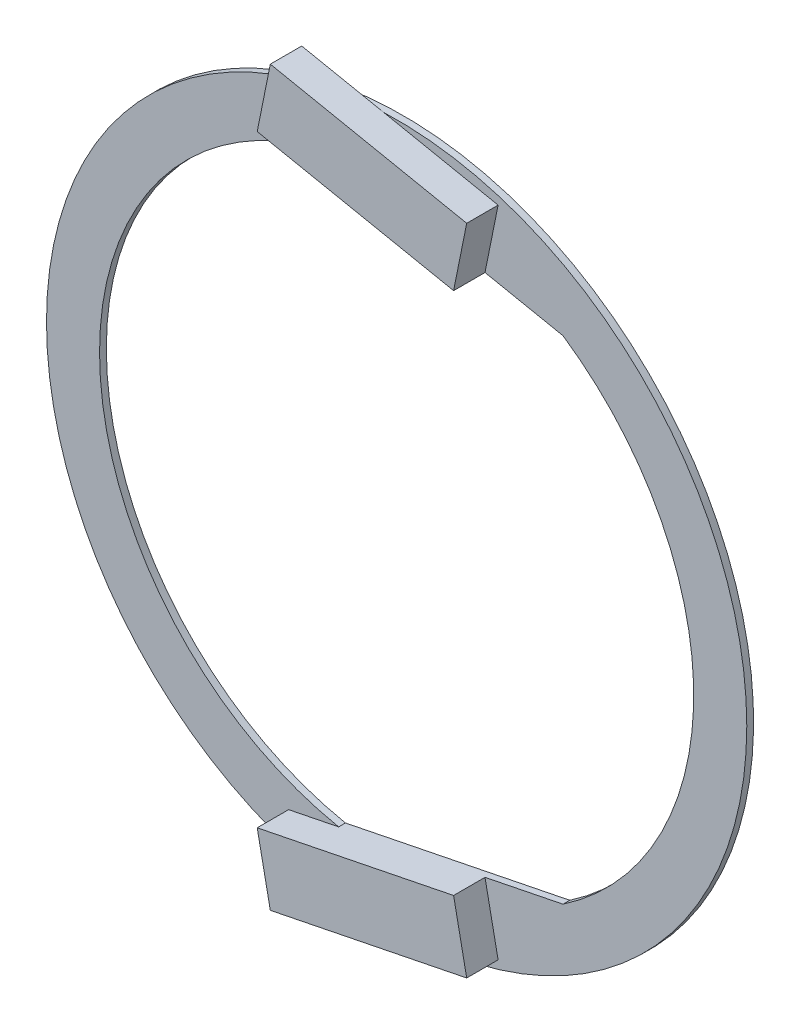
ISO-10303-21;
HEADER;
FILE_DESCRIPTION(('STEP AP214'),'2;1');
FILE_NAME('part.step','',(''),(''),'','','');
FILE_SCHEMA(('AUTOMOTIVE_DESIGN { 1 0 10303 214 1 1 1 1 }'));
ENDSEC;
DATA;
#1=APPLICATION_CONTEXT('core data for automotive mechanical design processes');
#2=APPLICATION_PROTOCOL_DEFINITION('international standard','automotive_design',2000,#1);
#3=PRODUCT_CONTEXT('',#1,'mechanical');
#4=PRODUCT('Part','Part','',(#3));
#5=PRODUCT_RELATED_PRODUCT_CATEGORY('part','',(#4));
#6=PRODUCT_DEFINITION_FORMATION('','',#4);
#7=PRODUCT_DEFINITION_CONTEXT('part definition',#1,'design');
#8=PRODUCT_DEFINITION('design','',#6,#7);
#9=PRODUCT_DEFINITION_SHAPE('','',#8);
#10=(LENGTH_UNIT() NAMED_UNIT(*) SI_UNIT(.MILLI.,.METRE.));
#11=(NAMED_UNIT(*) PLANE_ANGLE_UNIT() SI_UNIT($,.RADIAN.));
#12=(NAMED_UNIT(*) SI_UNIT($,.STERADIAN.) SOLID_ANGLE_UNIT());
#13=UNCERTAINTY_MEASURE_WITH_UNIT(LENGTH_MEASURE(1.E-05),#10,'distance_accuracy_value','');
#14=(GEOMETRIC_REPRESENTATION_CONTEXT(3) GLOBAL_UNCERTAINTY_ASSIGNED_CONTEXT((#13)) GLOBAL_UNIT_ASSIGNED_CONTEXT((#10,
#11,#12)) REPRESENTATION_CONTEXT('',''));
#15=CARTESIAN_POINT('',(0.,0.,0.));
#16=DIRECTION('',(0.,0.,1.));
#17=DIRECTION('',(1.,0.,0.));
#18=AXIS2_PLACEMENT_3D('',#15,#16,#17);
#19=CARTESIAN_POINT('',(0.,0.,0.));
#20=DIRECTION('',(0.,0.,-1.));
#21=DIRECTION('',(-1.,0.,0.));
#22=AXIS2_PLACEMENT_3D('',#19,#20,#21);
#23=PLANE('',#22);
#24=DIRECTION('',(-0.980271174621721,-0.19765734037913,0.));
#25=VECTOR('',#24,1.);
#26=CARTESIAN_POINT('',(-16.1606892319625,-45.1041303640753,0.));
#27=LINE('',#26,#25);
#28=CARTESIAN_POINT('',(-8.67627650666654,-43.5950080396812,0.));
#29=VERTEX_POINT('',#28);
#30=CARTESIAN_POINT('',(-16.1606892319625,-45.1041303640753,0.));
#31=VERTEX_POINT('',#30);
#32=EDGE_CURVE('E161',#29,#31,#27,.T.);
#33=ORIENTED_EDGE('',*,*,#32,.F.);
#34=CARTESIAN_POINT('',(0.,0.,0.));
#35=DIRECTION('',(0.,0.,-1.));
#36=DIRECTION('',(-1.,0.,0.));
#37=AXIS2_PLACEMENT_3D('',#34,#35,#36);
#38=CIRCLE('',#37,44.45);
#39=CARTESIAN_POINT('',(-8.6762765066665,43.5950080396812,0.));
#40=VERTEX_POINT('',#39);
#41=EDGE_CURVE('E165',#29,#40,#38,.T.);
#42=ORIENTED_EDGE('',*,*,#41,.T.);
#43=DIRECTION('',(0.980271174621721,-0.19765734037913,0.));
#44=VECTOR('',#43,1.);
#45=CARTESIAN_POINT('',(-16.1606892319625,45.1041303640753,0.));
#46=LINE('',#45,#44);
#47=CARTESIAN_POINT('',(-16.1606892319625,45.1041303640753,0.));
#48=VERTEX_POINT('',#47);
#49=EDGE_CURVE('E228',#48,#40,#46,.T.);
#50=ORIENTED_EDGE('',*,*,#49,.F.);
#51=DIRECTION('',(-0.197657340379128,-0.980271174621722,0.));
#52=VECTOR('',#51,1.);
#53=CARTESIAN_POINT('',(-14.2015519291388,54.8203686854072,0.));
#54=LINE('',#53,#52);
#55=CARTESIAN_POINT('',(-15.1430296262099,50.1511596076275,0.));
#56=VERTEX_POINT('',#55);
#57=EDGE_CURVE('E224',#56,#48,#54,.T.);
#58=ORIENTED_EDGE('',*,*,#57,.F.);
#59=CARTESIAN_POINT('',(0.,0.,0.));
#60=DIRECTION('',(0.,0.,-1.));
#61=DIRECTION('',(-1.,0.,0.));
#62=AXIS2_PLACEMENT_3D('',#59,#60,#61);
#63=CIRCLE('',#62,52.3875);
#64=CARTESIAN_POINT('',(-15.1430296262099,-50.1511596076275,0.));
#65=VERTEX_POINT('',#64);
#66=EDGE_CURVE('E201',#65,#56,#63,.T.);
#67=ORIENTED_EDGE('',*,*,#66,.F.);
#68=DIRECTION('',(0.197657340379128,-0.980271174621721,0.));
#69=VECTOR('',#68,1.);
#70=CARTESIAN_POINT('',(-14.2015519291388,-54.8203686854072,0.));
#71=LINE('',#70,#69);
#72=EDGE_CURVE('E52',#31,#65,#71,.T.);
#73=ORIENTED_EDGE('',*,*,#72,.F.);
#74=EDGE_LOOP('',(#33,#42,#50,#58,#67,#73));
#75=FACE_BOUND('',#74,.T.);
#76=ADVANCED_FACE('F37',(#75),#23,.F.);
#77=DIRECTION('',(0.980271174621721,0.19765734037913,0.));
#78=VECTOR('',#77,1.);
#79=CARTESIAN_POINT('',(15.1806892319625,-48.8958696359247,0.));
#80=LINE('',#79,#78);
#81=CARTESIAN_POINT('',(-1.95490886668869,-52.3510122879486,0.));
#82=VERTEX_POINT('',#81);
#83=CARTESIAN_POINT('',(15.1806892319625,-48.8958696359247,0.));
#84=VERTEX_POINT('',#83);
#85=EDGE_CURVE('E291',#82,#84,#80,.T.);
#86=ORIENTED_EDGE('',*,*,#85,.F.);
#87=CARTESIAN_POINT('',(-1.95490886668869,52.3510122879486,0.));
#88=VERTEX_POINT('',#87);
#89=EDGE_CURVE('E210',#88,#82,#63,.T.);
#90=ORIENTED_EDGE('',*,*,#89,.F.);
#91=DIRECTION('',(-0.980271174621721,0.19765734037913,0.));
#92=VECTOR('',#91,1.);
#93=CARTESIAN_POINT('',(15.1806892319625,48.8958696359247,0.));
#94=LINE('',#93,#92);
#95=CARTESIAN_POINT('',(15.1806892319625,48.8958696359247,0.));
#96=VERTEX_POINT('',#95);
#97=EDGE_CURVE('E222',#96,#88,#94,.T.);
#98=ORIENTED_EDGE('',*,*,#97,.F.);
#99=DIRECTION('',(0.19765734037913,0.980271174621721,0.));
#100=VECTOR('',#99,1.);
#101=CARTESIAN_POINT('',(13.2215519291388,39.1796313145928,0.));
#102=LINE('',#101,#100);
#103=CARTESIAN_POINT('',(13.2215519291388,39.1796313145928,0.));
#104=VERTEX_POINT('',#103);
#105=EDGE_CURVE('E215',#104,#96,#102,.T.);
#106=ORIENTED_EDGE('',*,*,#105,.F.);
#107=DIRECTION('',(0.980271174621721,-0.19765734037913,0.));
#108=VECTOR('',#107,1.);
#109=CARTESIAN_POINT('',(-8.67627650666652,43.5950080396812,0.));
#110=LINE('',#109,#108);
#111=CARTESIAN_POINT('',(24.8920847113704,36.8264391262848,0.));
#112=VERTEX_POINT('',#111);
#113=EDGE_CURVE('E185',#104,#112,#110,.T.);
#114=ORIENTED_EDGE('',*,*,#113,.T.);
#115=CARTESIAN_POINT('',(0.,0.,0.));
#116=DIRECTION('',(0.,0.,-1.));
#117=DIRECTION('',(-1.,0.,0.));
#118=AXIS2_PLACEMENT_3D('',#115,#116,#117);
#119=CIRCLE('',#118,44.45);
#120=CARTESIAN_POINT('',(24.8920847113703,-36.8264391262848,0.));
#121=VERTEX_POINT('',#120);
#122=EDGE_CURVE('E187',#112,#121,#119,.T.);
#123=ORIENTED_EDGE('',*,*,#122,.T.);
#124=DIRECTION('',(-0.980271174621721,-0.19765734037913,0.));
#125=VECTOR('',#124,1.);
#126=CARTESIAN_POINT('',(-8.67627650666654,-43.5950080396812,0.));
#127=LINE('',#126,#125);
#128=CARTESIAN_POINT('',(13.2215519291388,-39.1796313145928,0.));
#129=VERTEX_POINT('',#128);
#130=EDGE_CURVE('E174',#121,#129,#127,.T.);
#131=ORIENTED_EDGE('',*,*,#130,.T.);
#132=DIRECTION('',(-0.19765734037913,0.980271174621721,0.));
#133=VECTOR('',#132,1.);
#134=CARTESIAN_POINT('',(13.2215519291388,-39.1796313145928,0.));
#135=LINE('',#134,#133);
#136=EDGE_CURVE('E60',#84,#129,#135,.T.);
#137=ORIENTED_EDGE('',*,*,#136,.F.);
#138=EDGE_LOOP('',(#86,#90,#98,#106,#114,#123,#131,#137));
#139=FACE_BOUND('',#138,.T.);
#140=ADVANCED_FACE('F261',(#139),#23,.F.);
#141=CARTESIAN_POINT('',(15.1806892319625,48.8958696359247,4.7));
#142=DIRECTION('',(-0.19765734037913,-0.980271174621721,0.));
#143=DIRECTION('',(0.980271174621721,-0.19765734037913,0.));
#144=AXIS2_PLACEMENT_3D('',#141,#142,#143);
#145=PLANE('',#144);
#146=ORIENTED_EDGE('',*,*,#97,.T.);
#147=CARTESIAN_POINT('',(-14.2015519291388,54.8203686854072,0.));
#148=VERTEX_POINT('',#147);
#149=EDGE_CURVE('E206',#88,#148,#94,.T.);
#150=ORIENTED_EDGE('',*,*,#149,.T.);
#151=DIRECTION('',(0.,0.,-1.));
#152=VECTOR('',#151,1.);
#153=CARTESIAN_POINT('',(-14.2015519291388,54.8203686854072,4.7));
#154=LINE('',#153,#152);
#155=CARTESIAN_POINT('',(-14.2015519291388,54.8203686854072,4.7));
#156=VERTEX_POINT('',#155);
#157=EDGE_CURVE('E11',#156,#148,#154,.T.);
#158=ORIENTED_EDGE('',*,*,#157,.F.);
#159=DIRECTION('',(-0.980271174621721,0.19765734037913,0.));
#160=VECTOR('',#159,1.);
#161=CARTESIAN_POINT('',(15.1806892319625,48.8958696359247,4.7));
#162=LINE('',#161,#160);
#163=CARTESIAN_POINT('',(15.1806892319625,48.8958696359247,4.7));
#164=VERTEX_POINT('',#163);
#165=EDGE_CURVE('E211',#164,#156,#162,.T.);
#166=ORIENTED_EDGE('',*,*,#165,.F.);
#167=DIRECTION('',(0.,0.,-1.));
#168=VECTOR('',#167,1.);
#169=CARTESIAN_POINT('',(15.1806892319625,48.8958696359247,4.7));
#170=LINE('',#169,#168);
#171=EDGE_CURVE('E221',#164,#96,#170,.T.);
#172=ORIENTED_EDGE('',*,*,#171,.T.);
#173=EDGE_LOOP('',(#146,#150,#158,#166,#172));
#174=FACE_BOUND('',#173,.T.);
#175=ADVANCED_FACE('F39',(#174),#145,.F.);
#176=CARTESIAN_POINT('',(-14.2015519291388,54.8203686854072,4.7));
#177=DIRECTION('',(0.980271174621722,-0.197657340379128,0.));
#178=DIRECTION('',(0.197657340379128,0.980271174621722,0.));
#179=AXIS2_PLACEMENT_3D('',#176,#177,#178);
#180=PLANE('',#179);
#181=EDGE_CURVE('E225',#148,#56,#54,.T.);
#182=ORIENTED_EDGE('',*,*,#181,.T.);
#183=ORIENTED_EDGE('',*,*,#57,.T.);
#184=DIRECTION('',(0.,0.,-1.));
#185=VECTOR('',#184,1.);
#186=CARTESIAN_POINT('',(-16.1606892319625,45.1041303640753,4.7));
#187=LINE('',#186,#185);
#188=CARTESIAN_POINT('',(-16.1606892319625,45.1041303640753,4.7));
#189=VERTEX_POINT('',#188);
#190=EDGE_CURVE('E45',#189,#48,#187,.T.);
#191=ORIENTED_EDGE('',*,*,#190,.F.);
#192=DIRECTION('',(-0.197657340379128,-0.980271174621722,0.));
#193=VECTOR('',#192,1.);
#194=CARTESIAN_POINT('',(-14.2015519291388,54.8203686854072,4.7));
#195=LINE('',#194,#193);
#196=EDGE_CURVE('E214',#156,#189,#195,.T.);
#197=ORIENTED_EDGE('',*,*,#196,.F.);
#198=ORIENTED_EDGE('',*,*,#157,.T.);
#199=EDGE_LOOP('',(#182,#183,#191,#197,#198));
#200=FACE_BOUND('',#199,.T.);
#201=ADVANCED_FACE('F273',(#200),#180,.F.);
#202=CARTESIAN_POINT('',(-16.1606892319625,45.1041303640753,4.7));
#203=DIRECTION('',(0.19765734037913,0.980271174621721,0.));
#204=DIRECTION('',(-0.980271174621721,0.19765734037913,0.));
#205=AXIS2_PLACEMENT_3D('',#202,#203,#204);
#206=PLANE('',#205);
#207=ORIENTED_EDGE('',*,*,#49,.T.);
#208=DIRECTION('',(0.,0.,1.));
#209=VECTOR('',#208,1.);
#210=CARTESIAN_POINT('',(-8.67627650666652,43.5950080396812,-1.016));
#211=LINE('',#210,#209);
#212=CARTESIAN_POINT('',(-8.67627650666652,43.5950080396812,-1.016));
#213=VERTEX_POINT('',#212);
#214=EDGE_CURVE('E198',#213,#40,#211,.T.);
#215=ORIENTED_EDGE('',*,*,#214,.F.);
#216=DIRECTION('',(0.980271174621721,-0.19765734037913,0.));
#217=VECTOR('',#216,1.);
#218=CARTESIAN_POINT('',(-8.67627650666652,43.5950080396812,-1.016));
#219=LINE('',#218,#217);
#220=CARTESIAN_POINT('',(24.8920847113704,36.8264391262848,-1.016));
#221=VERTEX_POINT('',#220);
#222=EDGE_CURVE('E173',#213,#221,#219,.T.);
#223=ORIENTED_EDGE('',*,*,#222,.T.);
#224=DIRECTION('',(0.,0.,1.));
#225=VECTOR('',#224,1.);
#226=CARTESIAN_POINT('',(24.8920847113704,36.8264391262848,-1.016));
#227=LINE('',#226,#225);
#228=EDGE_CURVE('E195',#221,#112,#227,.T.);
#229=ORIENTED_EDGE('',*,*,#228,.T.);
#230=ORIENTED_EDGE('',*,*,#113,.F.);
#231=DIRECTION('',(0.,0.,-1.));
#232=VECTOR('',#231,1.);
#233=CARTESIAN_POINT('',(13.2215519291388,39.1796313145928,4.7));
#234=LINE('',#233,#232);
#235=CARTESIAN_POINT('',(13.2215519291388,39.1796313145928,4.7));
#236=VERTEX_POINT('',#235);
#237=EDGE_CURVE('E233',#236,#104,#234,.T.);
#238=ORIENTED_EDGE('',*,*,#237,.F.);
#239=DIRECTION('',(0.980271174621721,-0.19765734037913,0.));
#240=VECTOR('',#239,1.);
#241=CARTESIAN_POINT('',(-16.1606892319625,45.1041303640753,4.7));
#242=LINE('',#241,#240);
#243=EDGE_CURVE('E217',#189,#236,#242,.T.);
#244=ORIENTED_EDGE('',*,*,#243,.F.);
#245=ORIENTED_EDGE('',*,*,#190,.T.);
#246=EDGE_LOOP('',(#207,#215,#223,#229,#230,#238,#244,#245));
#247=FACE_BOUND('',#246,.T.);
#248=ADVANCED_FACE('F239',(#247),#206,.F.);
#249=CARTESIAN_POINT('',(13.2215519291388,39.1796313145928,4.7));
#250=DIRECTION('',(-0.980271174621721,0.19765734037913,0.));
#251=DIRECTION('',(-0.19765734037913,-0.980271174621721,0.));
#252=AXIS2_PLACEMENT_3D('',#249,#250,#251);
#253=PLANE('',#252);
#254=ORIENTED_EDGE('',*,*,#105,.T.);
#255=ORIENTED_EDGE('',*,*,#171,.F.);
#256=DIRECTION('',(0.19765734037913,0.980271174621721,0.));
#257=VECTOR('',#256,1.);
#258=CARTESIAN_POINT('',(13.2215519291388,39.1796313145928,4.7));
#259=LINE('',#258,#257);
#260=EDGE_CURVE('E219',#236,#164,#259,.T.);
#261=ORIENTED_EDGE('',*,*,#260,.F.);
#262=ORIENTED_EDGE('',*,*,#237,.T.);
#263=EDGE_LOOP('',(#254,#255,#261,#262));
#264=FACE_BOUND('',#263,.T.);
#265=ADVANCED_FACE('F266',(#264),#253,.F.);
#266=CARTESIAN_POINT('',(0.,0.,4.7));
#267=DIRECTION('',(0.,0.,1.));
#268=DIRECTION('',(1.,0.,0.));
#269=AXIS2_PLACEMENT_3D('',#266,#267,#268);
#270=PLANE('',#269);
#271=ORIENTED_EDGE('',*,*,#165,.T.);
#272=ORIENTED_EDGE('',*,*,#196,.T.);
#273=ORIENTED_EDGE('',*,*,#243,.T.);
#274=ORIENTED_EDGE('',*,*,#260,.T.);
#275=EDGE_LOOP('',(#271,#272,#273,#274));
#276=FACE_BOUND('',#275,.T.);
#277=ADVANCED_FACE('F272',(#276),#270,.T.);
#278=CARTESIAN_POINT('',(0.,0.,0.));
#279=DIRECTION('',(0.,0.,1.));
#280=DIRECTION('',(1.,0.,0.));
#281=AXIS2_PLACEMENT_3D('',#278,#279,#280);
#282=PLANE('',#281);
#283=EDGE_CURVE('E207',#56,#88,#63,.T.);
#284=ORIENTED_EDGE('',*,*,#283,.F.);
#285=ORIENTED_EDGE('',*,*,#181,.F.);
#286=ORIENTED_EDGE('',*,*,#149,.F.);
#287=EDGE_LOOP('',(#284,#285,#286));
#288=FACE_BOUND('',#287,.T.);
#289=ADVANCED_FACE('F277',(#288),#282,.F.);
#290=CARTESIAN_POINT('',(0.,0.,-1.016));
#291=DIRECTION('',(0.,0.,-1.));
#292=DIRECTION('',(-1.,0.,0.));
#293=AXIS2_PLACEMENT_3D('',#290,#291,#292);
#294=PLANE('',#293);
#295=CARTESIAN_POINT('',(0.,0.,-1.016));
#296=DIRECTION('',(0.,0.,-1.));
#297=DIRECTION('',(-1.,0.,0.));
#298=AXIS2_PLACEMENT_3D('',#295,#296,#297);
#299=CIRCLE('',#298,52.3875);
#300=CARTESIAN_POINT('',(-52.3875,0.,-1.016));
#301=VERTEX_POINT('',#300);
#302=EDGE_CURVE('E202',#301,#301,#299,.T.);
#303=ORIENTED_EDGE('',*,*,#302,.T.);
#304=EDGE_LOOP('',(#303));
#305=FACE_BOUND('',#304,.T.);
#306=ORIENTED_EDGE('',*,*,#222,.F.);
#307=CARTESIAN_POINT('',(0.,0.,-1.016));
#308=DIRECTION('',(0.,0.,-1.));
#309=DIRECTION('',(-1.,0.,0.));
#310=AXIS2_PLACEMENT_3D('',#307,#308,#309);
#311=CIRCLE('',#310,44.45);
#312=CARTESIAN_POINT('',(-8.67627650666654,-43.5950080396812,-1.016));
#313=VERTEX_POINT('',#312);
#314=EDGE_CURVE('E171',#313,#213,#311,.T.);
#315=ORIENTED_EDGE('',*,*,#314,.F.);
#316=DIRECTION('',(-0.980271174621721,-0.19765734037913,0.));
#317=VECTOR('',#316,1.);
#318=CARTESIAN_POINT('',(-8.67627650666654,-43.5950080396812,-1.016));
#319=LINE('',#318,#317);
#320=CARTESIAN_POINT('',(24.8920847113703,-36.8264391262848,-1.016));
#321=VERTEX_POINT('',#320);
#322=EDGE_CURVE('E180',#321,#313,#319,.T.);
#323=ORIENTED_EDGE('',*,*,#322,.F.);
#324=CARTESIAN_POINT('',(0.,0.,-1.016));
#325=DIRECTION('',(0.,0.,-1.));
#326=DIRECTION('',(-1.,0.,0.));
#327=AXIS2_PLACEMENT_3D('',#324,#325,#326);
#328=CIRCLE('',#327,44.45);
#329=EDGE_CURVE('E176',#221,#321,#328,.T.);
#330=ORIENTED_EDGE('',*,*,#329,.F.);
#331=EDGE_LOOP('',(#306,#315,#323,#330));
#332=FACE_BOUND('',#331,.T.);
#333=ADVANCED_FACE('F253',(#305,#332),#294,.T.);
#334=CARTESIAN_POINT('',(0.,0.,-1.016));
#335=DIRECTION('',(0.,0.,1.));
#336=DIRECTION('',(1.,0.,0.));
#337=AXIS2_PLACEMENT_3D('',#334,#335,#336);
#338=CYLINDRICAL_SURFACE('',#337,52.3875);
#339=ORIENTED_EDGE('',*,*,#302,.F.);
#340=EDGE_LOOP('',(#339));
#341=FACE_BOUND('',#340,.T.);
#342=ORIENTED_EDGE('',*,*,#283,.T.);
#343=ORIENTED_EDGE('',*,*,#89,.T.);
#344=CARTESIAN_POINT('',(0.,0.,0.));
#345=DIRECTION('',(0.,0.,-1.));
#346=DIRECTION('',(-1.,0.,0.));
#347=AXIS2_PLACEMENT_3D('',#344,#345,#346);
#348=CIRCLE('',#347,52.3875);
#349=EDGE_CURVE('E162',#82,#65,#348,.T.);
#350=ORIENTED_EDGE('',*,*,#349,.T.);
#351=ORIENTED_EDGE('',*,*,#66,.T.);
#352=EDGE_LOOP('',(#342,#343,#350,#351));
#353=FACE_BOUND('',#352,.T.);
#354=ADVANCED_FACE('F280',(#341,#353),#338,.T.);
#355=CARTESIAN_POINT('',(0.,0.,-1.016));
#356=DIRECTION('',(0.,0.,1.));
#357=DIRECTION('',(1.,0.,0.));
#358=AXIS2_PLACEMENT_3D('',#355,#356,#357);
#359=CYLINDRICAL_SURFACE('',#358,44.45);
#360=ORIENTED_EDGE('',*,*,#41,.F.);
#361=DIRECTION('',(0.,0.,1.));
#362=VECTOR('',#361,1.);
#363=CARTESIAN_POINT('',(-8.67627650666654,-43.5950080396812,-1.016));
#364=LINE('',#363,#362);
#365=EDGE_CURVE('E182',#313,#29,#364,.T.);
#366=ORIENTED_EDGE('',*,*,#365,.F.);
#367=ORIENTED_EDGE('',*,*,#314,.T.);
#368=ORIENTED_EDGE('',*,*,#214,.T.);
#369=EDGE_LOOP('',(#360,#366,#367,#368));
#370=FACE_BOUND('',#369,.T.);
#371=ADVANCED_FACE('F247',(#370),#359,.F.);
#372=CARTESIAN_POINT('',(0.,0.,-1.016));
#373=DIRECTION('',(0.,0.,1.));
#374=DIRECTION('',(1.,0.,0.));
#375=AXIS2_PLACEMENT_3D('',#372,#373,#374);
#376=CYLINDRICAL_SURFACE('',#375,44.45);
#377=ORIENTED_EDGE('',*,*,#122,.F.);
#378=ORIENTED_EDGE('',*,*,#228,.F.);
#379=ORIENTED_EDGE('',*,*,#329,.T.);
#380=DIRECTION('',(0.,0.,1.));
#381=VECTOR('',#380,1.);
#382=CARTESIAN_POINT('',(24.8920847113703,-36.8264391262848,-1.016));
#383=LINE('',#382,#381);
#384=EDGE_CURVE('E193',#321,#121,#383,.T.);
#385=ORIENTED_EDGE('',*,*,#384,.T.);
#386=EDGE_LOOP('',(#377,#378,#379,#385));
#387=FACE_BOUND('',#386,.T.);
#388=ADVANCED_FACE('F257',(#387),#376,.F.);
#389=CARTESIAN_POINT('',(-8.67627650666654,-43.5950080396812,-1.016));
#390=DIRECTION('',(-0.19765734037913,0.980271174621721,0.));
#391=DIRECTION('',(-0.980271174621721,-0.19765734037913,0.));
#392=AXIS2_PLACEMENT_3D('',#389,#390,#391);
#393=PLANE('',#392);
#394=ORIENTED_EDGE('',*,*,#130,.F.);
#395=ORIENTED_EDGE('',*,*,#384,.F.);
#396=ORIENTED_EDGE('',*,*,#322,.T.);
#397=ORIENTED_EDGE('',*,*,#365,.T.);
#398=ORIENTED_EDGE('',*,*,#32,.T.);
#399=DIRECTION('',(0.,0.,-1.));
#400=VECTOR('',#399,1.);
#401=CARTESIAN_POINT('',(-16.1606892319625,-45.1041303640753,4.7));
#402=LINE('',#401,#400);
#403=CARTESIAN_POINT('',(-16.1606892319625,-45.1041303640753,4.7));
#404=VERTEX_POINT('',#403);
#405=EDGE_CURVE('E143',#404,#31,#402,.T.);
#406=ORIENTED_EDGE('',*,*,#405,.F.);
#407=DIRECTION('',(-0.980271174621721,-0.19765734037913,0.));
#408=VECTOR('',#407,1.);
#409=CARTESIAN_POINT('',(-16.1606892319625,-45.1041303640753,4.7));
#410=LINE('',#409,#408);
#411=CARTESIAN_POINT('',(13.2215519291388,-39.1796313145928,4.7));
#412=VERTEX_POINT('',#411);
#413=EDGE_CURVE('E149',#412,#404,#410,.T.);
#414=ORIENTED_EDGE('',*,*,#413,.F.);
#415=DIRECTION('',(0.,0.,-1.));
#416=VECTOR('',#415,1.);
#417=CARTESIAN_POINT('',(13.2215519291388,-39.1796313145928,4.7));
#418=LINE('',#417,#416);
#419=EDGE_CURVE('E297',#412,#129,#418,.T.);
#420=ORIENTED_EDGE('',*,*,#419,.T.);
#421=EDGE_LOOP('',(#394,#395,#396,#397,#398,#406,#414,#420));
#422=FACE_BOUND('',#421,.T.);
#423=ADVANCED_FACE('F160',(#422),#393,.T.);
#424=CARTESIAN_POINT('',(0.,0.,0.));
#425=DIRECTION('',(0.,0.,-1.));
#426=DIRECTION('',(-1.,0.,0.));
#427=AXIS2_PLACEMENT_3D('',#424,#425,#426);
#428=PLANE('',#427);
#429=ORIENTED_EDGE('',*,*,#349,.F.);
#430=CARTESIAN_POINT('',(-14.2015519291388,-54.8203686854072,0.));
#431=VERTEX_POINT('',#430);
#432=EDGE_CURVE('E289',#431,#82,#80,.T.);
#433=ORIENTED_EDGE('',*,*,#432,.F.);
#434=EDGE_CURVE('E287',#65,#431,#71,.T.);
#435=ORIENTED_EDGE('',*,*,#434,.F.);
#436=EDGE_LOOP('',(#429,#433,#435));
#437=FACE_BOUND('',#436,.T.);
#438=ADVANCED_FACE('F288',(#437),#428,.T.);
#439=CARTESIAN_POINT('',(-14.2015519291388,-54.8203686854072,4.7));
#440=DIRECTION('',(0.980271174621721,0.197657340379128,0.));
#441=DIRECTION('',(-0.197657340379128,0.980271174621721,0.));
#442=AXIS2_PLACEMENT_3D('',#439,#440,#441);
#443=PLANE('',#442);
#444=ORIENTED_EDGE('',*,*,#72,.T.);
#445=ORIENTED_EDGE('',*,*,#434,.T.);
#446=DIRECTION('',(0.,0.,-1.));
#447=VECTOR('',#446,1.);
#448=CARTESIAN_POINT('',(-14.2015519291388,-54.8203686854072,4.7));
#449=LINE('',#448,#447);
#450=CARTESIAN_POINT('',(-14.2015519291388,-54.8203686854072,4.7));
#451=VERTEX_POINT('',#450);
#452=EDGE_CURVE('E145',#451,#431,#449,.T.);
#453=ORIENTED_EDGE('',*,*,#452,.F.);
#454=DIRECTION('',(0.197657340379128,-0.980271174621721,0.));
#455=VECTOR('',#454,1.);
#456=CARTESIAN_POINT('',(-14.2015519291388,-54.8203686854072,4.7));
#457=LINE('',#456,#455);
#458=EDGE_CURVE('E139',#404,#451,#457,.T.);
#459=ORIENTED_EDGE('',*,*,#458,.F.);
#460=ORIENTED_EDGE('',*,*,#405,.T.);
#461=EDGE_LOOP('',(#444,#445,#453,#459,#460));
#462=FACE_BOUND('',#461,.T.);
#463=ADVANCED_FACE('F141',(#462),#443,.F.);
#464=CARTESIAN_POINT('',(15.1806892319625,-48.8958696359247,4.7));
#465=DIRECTION('',(-0.19765734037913,0.980271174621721,0.));
#466=DIRECTION('',(-0.980271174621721,-0.19765734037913,0.));
#467=AXIS2_PLACEMENT_3D('',#464,#465,#466);
#468=PLANE('',#467);
#469=ORIENTED_EDGE('',*,*,#432,.T.);
#470=ORIENTED_EDGE('',*,*,#85,.T.);
#471=DIRECTION('',(0.,0.,-1.));
#472=VECTOR('',#471,1.);
#473=CARTESIAN_POINT('',(15.1806892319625,-48.8958696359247,4.7));
#474=LINE('',#473,#472);
#475=CARTESIAN_POINT('',(15.1806892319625,-48.8958696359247,4.7));
#476=VERTEX_POINT('',#475);
#477=EDGE_CURVE('E167',#476,#84,#474,.T.);
#478=ORIENTED_EDGE('',*,*,#477,.F.);
#479=DIRECTION('',(0.980271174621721,0.19765734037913,0.));
#480=VECTOR('',#479,1.);
#481=CARTESIAN_POINT('',(15.1806892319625,-48.8958696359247,4.7));
#482=LINE('',#481,#480);
#483=EDGE_CURVE('E148',#451,#476,#482,.T.);
#484=ORIENTED_EDGE('',*,*,#483,.F.);
#485=ORIENTED_EDGE('',*,*,#452,.T.);
#486=EDGE_LOOP('',(#469,#470,#478,#484,#485));
#487=FACE_BOUND('',#486,.T.);
#488=ADVANCED_FACE('F303',(#487),#468,.F.);
#489=CARTESIAN_POINT('',(13.2215519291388,-39.1796313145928,4.7));
#490=DIRECTION('',(-0.980271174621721,-0.19765734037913,0.));
#491=DIRECTION('',(0.19765734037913,-0.980271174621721,0.));
#492=AXIS2_PLACEMENT_3D('',#489,#490,#491);
#493=PLANE('',#492);
#494=ORIENTED_EDGE('',*,*,#136,.T.);
#495=ORIENTED_EDGE('',*,*,#419,.F.);
#496=DIRECTION('',(-0.19765734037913,0.980271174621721,0.));
#497=VECTOR('',#496,1.);
#498=CARTESIAN_POINT('',(13.2215519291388,-39.1796313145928,4.7));
#499=LINE('',#498,#497);
#500=EDGE_CURVE('E154',#476,#412,#499,.T.);
#501=ORIENTED_EDGE('',*,*,#500,.F.);
#502=ORIENTED_EDGE('',*,*,#477,.T.);
#503=EDGE_LOOP('',(#494,#495,#501,#502));
#504=FACE_BOUND('',#503,.T.);
#505=ADVANCED_FACE('F301',(#504),#493,.F.);
#506=CARTESIAN_POINT('',(0.,0.,4.7));
#507=DIRECTION('',(0.,0.,-1.));
#508=DIRECTION('',(-1.,0.,0.));
#509=AXIS2_PLACEMENT_3D('',#506,#507,#508);
#510=PLANE('',#509);
#511=ORIENTED_EDGE('',*,*,#413,.T.);
#512=ORIENTED_EDGE('',*,*,#458,.T.);
#513=ORIENTED_EDGE('',*,*,#483,.T.);
#514=ORIENTED_EDGE('',*,*,#500,.T.);
#515=EDGE_LOOP('',(#511,#512,#513,#514));
#516=FACE_BOUND('',#515,.T.);
#517=ADVANCED_FACE('F152',(#516),#510,.F.);
#518=CLOSED_SHELL('',(#76,#140,#175,#201,#248,#265,#277,#289,#333,#354,#371,#388,#423,#438,#463,
#488,#505,#517));
#519=MANIFOLD_SOLID_BREP('B2',#518);
#520=ADVANCED_BREP_SHAPE_REPRESENTATION('',(#18,#519),#14);
#521=SHAPE_DEFINITION_REPRESENTATION(#9,#520);
ENDSEC;
END-ISO-10303-21;
